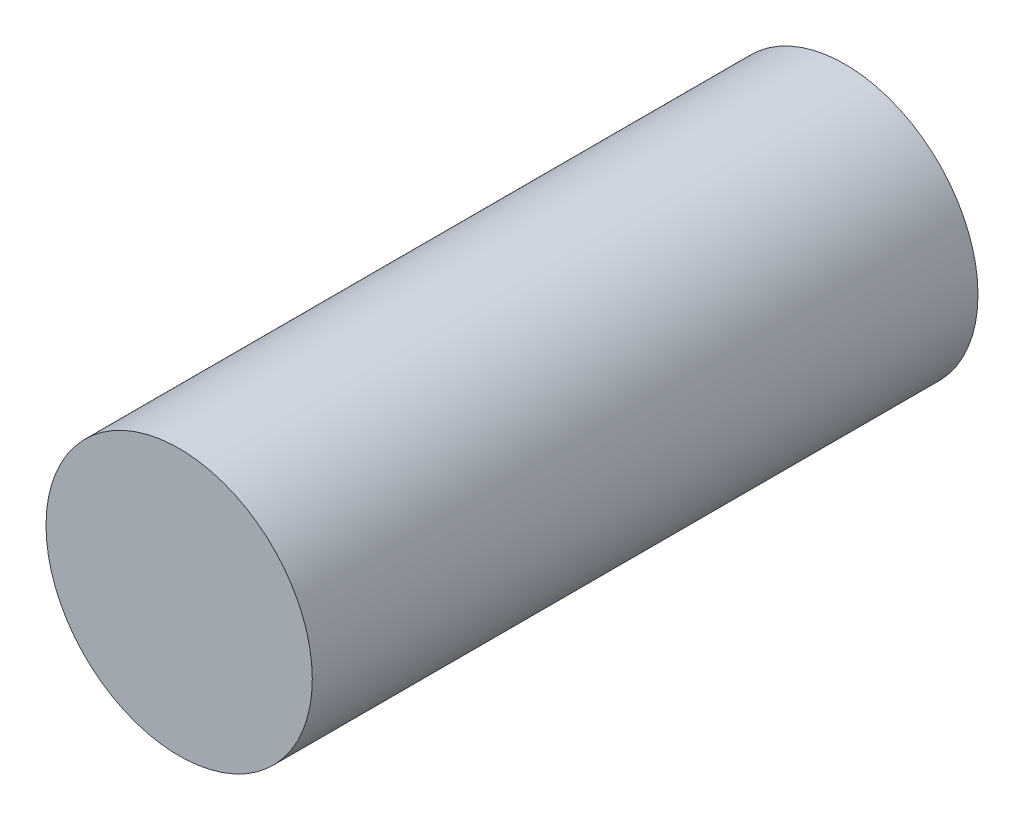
ISO-10303-21;
HEADER;
FILE_DESCRIPTION(('STEP AP214'),'2;1');
FILE_NAME('part.step','',(''),(''),'','','');
FILE_SCHEMA(('AUTOMOTIVE_DESIGN { 1 0 10303 214 1 1 1 1 }'));
ENDSEC;
DATA;
#1=APPLICATION_CONTEXT('core data for automotive mechanical design processes');
#2=APPLICATION_PROTOCOL_DEFINITION('international standard','automotive_design',2000,#1);
#3=PRODUCT_CONTEXT('',#1,'mechanical');
#4=PRODUCT('Part','Part','',(#3));
#5=PRODUCT_RELATED_PRODUCT_CATEGORY('part','',(#4));
#6=PRODUCT_DEFINITION_FORMATION('','',#4);
#7=PRODUCT_DEFINITION_CONTEXT('part definition',#1,'design');
#8=PRODUCT_DEFINITION('design','',#6,#7);
#9=PRODUCT_DEFINITION_SHAPE('','',#8);
#10=(LENGTH_UNIT() NAMED_UNIT(*) SI_UNIT(.MILLI.,.METRE.));
#11=(NAMED_UNIT(*) PLANE_ANGLE_UNIT() SI_UNIT($,.RADIAN.));
#12=(NAMED_UNIT(*) SI_UNIT($,.STERADIAN.) SOLID_ANGLE_UNIT());
#13=UNCERTAINTY_MEASURE_WITH_UNIT(LENGTH_MEASURE(1.E-05),#10,'distance_accuracy_value','');
#14=(GEOMETRIC_REPRESENTATION_CONTEXT(3) GLOBAL_UNCERTAINTY_ASSIGNED_CONTEXT((#13)) GLOBAL_UNIT_ASSIGNED_CONTEXT((#10,
#11,#12)) REPRESENTATION_CONTEXT('',''));
#15=CARTESIAN_POINT('',(0.,0.,0.));
#16=DIRECTION('',(0.,0.,1.));
#17=DIRECTION('',(1.,0.,0.));
#18=AXIS2_PLACEMENT_3D('',#15,#16,#17);
#19=CARTESIAN_POINT('',(0.,0.,38.1));
#20=DIRECTION('',(0.,0.,-1.));
#21=DIRECTION('',(-1.,0.,0.));
#22=AXIS2_PLACEMENT_3D('',#19,#20,#21);
#23=CYLINDRICAL_SURFACE('',#22,12.7);
#24=CARTESIAN_POINT('',(0.,0.,38.1));
#25=DIRECTION('',(0.,0.,1.));
#26=DIRECTION('',(1.,0.,0.));
#27=AXIS2_PLACEMENT_3D('',#24,#25,#26);
#28=CIRCLE('',#27,12.7);
#29=CARTESIAN_POINT('',(-12.7,0.,38.1));
#30=VERTEX_POINT('',#29);
#31=EDGE_CURVE('E10',#30,#30,#28,.T.);
#32=CARTESIAN_POINT('',(0.,0.,-25.4));
#33=DIRECTION('',(0.,0.,1.));
#34=DIRECTION('',(1.,0.,0.));
#35=AXIS2_PLACEMENT_3D('',#32,#33,#34);
#36=CIRCLE('',#35,12.7);
#37=CARTESIAN_POINT('',(-12.7,0.,-25.4));
#38=VERTEX_POINT('',#37);
#39=EDGE_CURVE('E30',#38,#38,#36,.T.);
#40=CARTESIAN_POINT('',(-12.7,0.,38.1));
#41=CARTESIAN_POINT('',(-12.7,0.,37.4385416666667));
#42=CARTESIAN_POINT('',(-12.7,0.,36.7770833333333));
#43=CARTESIAN_POINT('',(-12.7,0.,35.4541666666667));
#44=CARTESIAN_POINT('',(-12.7,0.,34.7927083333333));
#45=CARTESIAN_POINT('',(-12.7,0.,33.4697916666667));
#46=CARTESIAN_POINT('',(-12.7,0.,32.8083333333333));
#47=CARTESIAN_POINT('',(-12.7,0.,31.4854166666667));
#48=CARTESIAN_POINT('',(-12.7,0.,30.8239583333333));
#49=CARTESIAN_POINT('',(-12.7,0.,29.5010416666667));
#50=CARTESIAN_POINT('',(-12.7,0.,28.8395833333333));
#51=CARTESIAN_POINT('',(-12.7,0.,27.5166666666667));
#52=CARTESIAN_POINT('',(-12.7,0.,26.8552083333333));
#53=CARTESIAN_POINT('',(-12.7,0.,25.5322916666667));
#54=CARTESIAN_POINT('',(-12.7,0.,24.8708333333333));
#55=CARTESIAN_POINT('',(-12.7,0.,23.5479166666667));
#56=CARTESIAN_POINT('',(-12.7,0.,22.8864583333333));
#57=CARTESIAN_POINT('',(-12.7,0.,21.5635416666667));
#58=CARTESIAN_POINT('',(-12.7,0.,20.9020833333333));
#59=CARTESIAN_POINT('',(-12.7,0.,19.5791666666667));
#60=CARTESIAN_POINT('',(-12.7,0.,18.9177083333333));
#61=CARTESIAN_POINT('',(-12.7,0.,17.5947916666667));
#62=CARTESIAN_POINT('',(-12.7,0.,16.9333333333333));
#63=CARTESIAN_POINT('',(-12.7,0.,15.6104166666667));
#64=CARTESIAN_POINT('',(-12.7,0.,14.9489583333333));
#65=CARTESIAN_POINT('',(-12.7,0.,13.6260416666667));
#66=CARTESIAN_POINT('',(-12.7,0.,12.9645833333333));
#67=CARTESIAN_POINT('',(-12.7,0.,11.6416666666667));
#68=CARTESIAN_POINT('',(-12.7,0.,10.9802083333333));
#69=CARTESIAN_POINT('',(-12.7,0.,9.65729166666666));
#70=CARTESIAN_POINT('',(-12.7,0.,8.99583333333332));
#71=CARTESIAN_POINT('',(-12.7,0.,7.67291666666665));
#72=CARTESIAN_POINT('',(-12.7,0.,7.01145833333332));
#73=CARTESIAN_POINT('',(-12.7,0.,5.68854166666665));
#74=CARTESIAN_POINT('',(-12.7,0.,5.02708333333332));
#75=CARTESIAN_POINT('',(-12.7,0.,3.70416666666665));
#76=CARTESIAN_POINT('',(-12.7,0.,3.04270833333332));
#77=CARTESIAN_POINT('',(-12.7,0.,1.71979166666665));
#78=CARTESIAN_POINT('',(-12.7,0.,1.05833333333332));
#79=CARTESIAN_POINT('',(-12.7,0.,-0.264583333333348));
#80=CARTESIAN_POINT('',(-12.7,0.,-0.92604166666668));
#81=CARTESIAN_POINT('',(-12.7,0.,-2.24895833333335));
#82=CARTESIAN_POINT('',(-12.7,0.,-2.91041666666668));
#83=CARTESIAN_POINT('',(-12.7,0.,-4.23333333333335));
#84=CARTESIAN_POINT('',(-12.7,0.,-4.89479166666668));
#85=CARTESIAN_POINT('',(-12.7,0.,-6.21770833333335));
#86=CARTESIAN_POINT('',(-12.7,0.,-6.87916666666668));
#87=CARTESIAN_POINT('',(-12.7,0.,-8.20208333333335));
#88=CARTESIAN_POINT('',(-12.7,0.,-8.86354166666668));
#89=CARTESIAN_POINT('',(-12.7,0.,-10.1864583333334));
#90=CARTESIAN_POINT('',(-12.7,0.,-10.8479166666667));
#91=CARTESIAN_POINT('',(-12.7,0.,-12.1708333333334));
#92=CARTESIAN_POINT('',(-12.7,0.,-12.8322916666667));
#93=CARTESIAN_POINT('',(-12.7,0.,-14.1552083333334));
#94=CARTESIAN_POINT('',(-12.7,0.,-14.8166666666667));
#95=CARTESIAN_POINT('',(-12.7,0.,-16.1395833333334));
#96=CARTESIAN_POINT('',(-12.7,0.,-16.8010416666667));
#97=CARTESIAN_POINT('',(-12.7,0.,-18.1239583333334));
#98=CARTESIAN_POINT('',(-12.7,0.,-18.7854166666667));
#99=CARTESIAN_POINT('',(-12.7,0.,-20.1083333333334));
#100=CARTESIAN_POINT('',(-12.7,0.,-20.7697916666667));
#101=CARTESIAN_POINT('',(-12.7,0.,-22.0927083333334));
#102=CARTESIAN_POINT('',(-12.7,0.,-22.7541666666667));
#103=CARTESIAN_POINT('',(-12.7,0.,-24.0770833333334));
#104=CARTESIAN_POINT('',(-12.7,0.,-24.7385416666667));
#105=CARTESIAN_POINT('',(-12.7,0.,-25.4));
#106=B_SPLINE_CURVE_WITH_KNOTS('',3,(#40,#41,#42,#43,#44,#45,#46,#47,#48,#49,#50,#51,#52,#53,
#54,#55,#56,#57,#58,#59,#60,#61,#62,#63,#64,#65,#66,#67,#68,#69,#70,#71,#72,#73,#74,#75,#76,#77,
#78,#79,#80,#81,#82,#83,#84,#85,#86,#87,#88,#89,#90,#91,#92,#93,#94,#95,#96,#97,#98,#99,#100,
#101,#102,#103,#104,#105),.UNSPECIFIED.,.F.,.F.,(4,2,2,2,2,2,2,2,2,2,2,2,2,2,2,2,2,2,2,2,2,2,2,
2,2,2,2,2,2,2,2,2,4),(0.,1.984375,3.96875,5.953125,7.9375,9.921875,11.90625,13.890625,15.875,
17.859375,19.84375,21.828125,23.8125,25.796875,27.78125,29.765625,31.75,33.734375,35.71875,
37.703125,39.6875,41.671875,43.65625,45.640625,47.625,49.609375,51.59375,53.578125,55.5625,
57.546875,59.53125,61.515625,63.5),.UNSPECIFIED.);
#107=EDGE_CURVE('BSEAM24',#30,#38,#106,.T.);
#108=ORIENTED_EDGE('',*,*,#31,.F.);
#109=ORIENTED_EDGE('',*,*,#39,.T.);
#110=ORIENTED_EDGE('',*,*,#107,.T.);
#111=ORIENTED_EDGE('',*,*,#107,.F.);
#112=EDGE_LOOP('',(#108,#110,#109,#111));
#113=FACE_BOUND('',#112,.T.);
#114=ADVANCED_FACE('F24',(#113),#23,.T.);
#115=CARTESIAN_POINT('',(0.,0.,38.1));
#116=DIRECTION('',(0.,0.,1.));
#117=DIRECTION('',(1.,0.,0.));
#118=AXIS2_PLACEMENT_3D('',#115,#116,#117);
#119=PLANE('',#118);
#120=ORIENTED_EDGE('',*,*,#31,.T.);
#121=EDGE_LOOP('',(#120));
#122=FACE_BOUND('',#121,.T.);
#123=ADVANCED_FACE('F39',(#122),#119,.T.);
#124=CARTESIAN_POINT('',(0.,0.,-25.4));
#125=DIRECTION('',(0.,0.,1.));
#126=DIRECTION('',(1.,0.,0.));
#127=AXIS2_PLACEMENT_3D('',#124,#125,#126);
#128=PLANE('',#127);
#129=ORIENTED_EDGE('',*,*,#39,.F.);
#130=EDGE_LOOP('',(#129));
#131=FACE_BOUND('',#130,.T.);
#132=ADVANCED_FACE('F37',(#131),#128,.F.);
#133=CLOSED_SHELL('',(#114,#123,#132));
#134=MANIFOLD_SOLID_BREP('B2',#133);
#135=ADVANCED_BREP_SHAPE_REPRESENTATION('',(#18,#134),#14);
#136=SHAPE_DEFINITION_REPRESENTATION(#9,#135);
ENDSEC;
END-ISO-10303-21;
